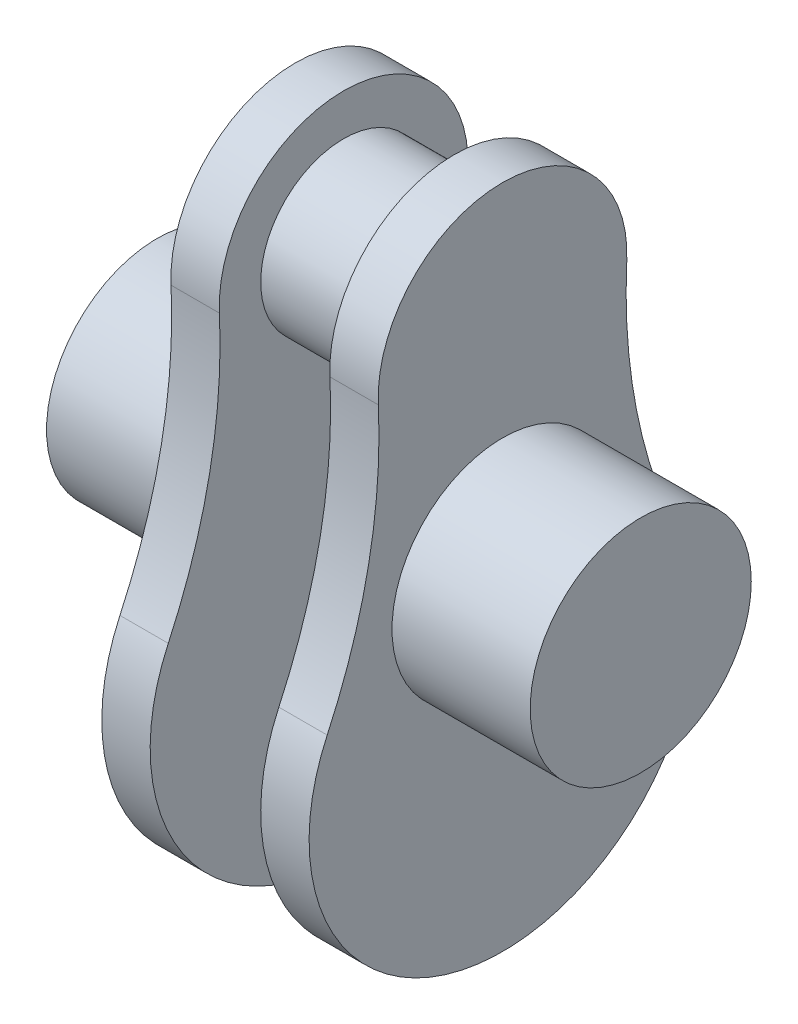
ISO-10303-21;
HEADER;
FILE_DESCRIPTION(('STEP AP214'),'2;1');
FILE_NAME('part.step','',(''),(''),'','','');
FILE_SCHEMA(('AUTOMOTIVE_DESIGN { 1 0 10303 214 1 1 1 1 }'));
ENDSEC;
DATA;
#1=APPLICATION_CONTEXT('core data for automotive mechanical design processes');
#2=APPLICATION_PROTOCOL_DEFINITION('international standard','automotive_design',2000,#1);
#3=PRODUCT_CONTEXT('',#1,'mechanical');
#4=PRODUCT('Part','Part','',(#3));
#5=PRODUCT_RELATED_PRODUCT_CATEGORY('part','',(#4));
#6=PRODUCT_DEFINITION_FORMATION('','',#4);
#7=PRODUCT_DEFINITION_CONTEXT('part definition',#1,'design');
#8=PRODUCT_DEFINITION('design','',#6,#7);
#9=PRODUCT_DEFINITION_SHAPE('','',#8);
#10=(LENGTH_UNIT() NAMED_UNIT(*) SI_UNIT(.MILLI.,.METRE.));
#11=(NAMED_UNIT(*) PLANE_ANGLE_UNIT() SI_UNIT($,.RADIAN.));
#12=(NAMED_UNIT(*) SI_UNIT($,.STERADIAN.) SOLID_ANGLE_UNIT());
#13=UNCERTAINTY_MEASURE_WITH_UNIT(LENGTH_MEASURE(1.E-05),#10,'distance_accuracy_value','');
#14=(GEOMETRIC_REPRESENTATION_CONTEXT(3) GLOBAL_UNCERTAINTY_ASSIGNED_CONTEXT((#13)) GLOBAL_UNIT_ASSIGNED_CONTEXT((#10,
#11,#12)) REPRESENTATION_CONTEXT('',''));
#15=CARTESIAN_POINT('',(0.,0.,0.));
#16=DIRECTION('',(0.,0.,1.));
#17=DIRECTION('',(1.,0.,0.));
#18=AXIS2_PLACEMENT_3D('',#15,#16,#17);
#19=CARTESIAN_POINT('',(-37.5,0.,0.));
#20=DIRECTION('',(-1.,0.,0.));
#21=DIRECTION('',(0.,0.,1.));
#22=AXIS2_PLACEMENT_3D('',#19,#20,#21);
#23=CYLINDRICAL_SURFACE('',#22,40.);
#24=CARTESIAN_POINT('',(-37.5,0.,0.));
#25=DIRECTION('',(1.,0.,0.));
#26=DIRECTION('',(0.,0.,-1.));
#27=AXIS2_PLACEMENT_3D('',#24,#25,#26);
#28=CIRCLE('',#27,40.);
#29=CARTESIAN_POINT('',(-37.5,0.,-40.));
#30=VERTEX_POINT('',#29);
#31=EDGE_CURVE('E11',#30,#30,#28,.T.);
#32=ORIENTED_EDGE('',*,*,#31,.F.);
#33=EDGE_LOOP('',(#32));
#34=FACE_BOUND('',#33,.T.);
#35=CARTESIAN_POINT('',(-87.5,0.,0.));
#36=DIRECTION('',(1.,0.,0.));
#37=DIRECTION('',(0.,0.,-1.));
#38=AXIS2_PLACEMENT_3D('',#35,#36,#37);
#39=CIRCLE('',#38,40.);
#40=CARTESIAN_POINT('',(-87.5,0.,-40.));
#41=VERTEX_POINT('',#40);
#42=EDGE_CURVE('E40',#41,#41,#39,.T.);
#43=ORIENTED_EDGE('',*,*,#42,.T.);
#44=EDGE_LOOP('',(#43));
#45=FACE_BOUND('',#44,.T.);
#46=ADVANCED_FACE('F37',(#34,#45),#23,.T.);
#47=CARTESIAN_POINT('',(-87.5,0.,0.));
#48=DIRECTION('',(1.,0.,0.));
#49=DIRECTION('',(0.,0.,-1.));
#50=AXIS2_PLACEMENT_3D('',#47,#48,#49);
#51=PLANE('',#50);
#52=ORIENTED_EDGE('',*,*,#42,.F.);
#53=EDGE_LOOP('',(#52));
#54=FACE_BOUND('',#53,.T.);
#55=ADVANCED_FACE('F208',(#54),#51,.F.);
#56=CARTESIAN_POINT('',(258.713114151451,63.0912698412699,-244.710404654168));
#57=DIRECTION('',(-1.,0.,0.));
#58=DIRECTION('',(0.,0.,1.));
#59=AXIS2_PLACEMENT_3D('',#56,#57,#58);
#60=CYLINDRICAL_SURFACE('',#59,200.);
#61=CARTESIAN_POINT('',(-20.,63.0912698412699,-244.710404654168));
#62=DIRECTION('',(1.,0.,0.));
#63=DIRECTION('',(0.,0.,-1.));
#64=AXIS2_PLACEMENT_3D('',#61,#62,#63);
#65=CIRCLE('',#64,200.);
#66=CARTESIAN_POINT('',(-20.,-21.4207818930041,-63.4434382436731));
#67=VERTEX_POINT('',#66);
#68=CARTESIAN_POINT('',(-20.,72.8126822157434,-44.9468090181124));
#69=VERTEX_POINT('',#68);
#70=EDGE_CURVE('E178',#67,#69,#65,.F.);
#71=ORIENTED_EDGE('',*,*,#70,.F.);
#72=DIRECTION('',(-1.,0.,0.));
#73=VECTOR('',#72,1.);
#74=CARTESIAN_POINT('',(258.713114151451,-21.4207818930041,-63.4434382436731));
#75=LINE('',#74,#73);
#76=CARTESIAN_POINT('',(-37.5,-21.4207818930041,-63.4434382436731));
#77=VERTEX_POINT('',#76);
#78=EDGE_CURVE('E51',#67,#77,#75,.T.);
#79=ORIENTED_EDGE('',*,*,#78,.T.);
#80=CARTESIAN_POINT('',(-37.5,63.0912698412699,-244.710404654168));
#81=DIRECTION('',(-1.,0.,0.));
#82=DIRECTION('',(0.,0.,1.));
#83=AXIS2_PLACEMENT_3D('',#80,#81,#82);
#84=CIRCLE('',#83,200.);
#85=CARTESIAN_POINT('',(-37.5,72.8126822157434,-44.9468090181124));
#86=VERTEX_POINT('',#85);
#87=EDGE_CURVE('E171',#77,#86,#84,.T.);
#88=ORIENTED_EDGE('',*,*,#87,.T.);
#89=DIRECTION('',(-1.,0.,0.));
#90=VECTOR('',#89,1.);
#91=CARTESIAN_POINT('',(258.713114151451,72.8126822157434,-44.9468090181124));
#92=LINE('',#91,#90);
#93=EDGE_CURVE('E74',#69,#86,#92,.T.);
#94=ORIENTED_EDGE('',*,*,#93,.F.);
#95=EDGE_LOOP('',(#71,#79,#88,#94));
#96=FACE_BOUND('',#95,.T.);
#97=ADVANCED_FACE('F187',(#96),#60,.F.);
#98=CARTESIAN_POINT('',(258.713114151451,75.,0.));
#99=DIRECTION('',(-1.,0.,0.));
#100=DIRECTION('',(0.,0.,1.));
#101=AXIS2_PLACEMENT_3D('',#98,#99,#100);
#102=CYLINDRICAL_SURFACE('',#101,45.);
#103=CARTESIAN_POINT('',(-20.,75.,0.));
#104=DIRECTION('',(1.,0.,0.));
#105=DIRECTION('',(0.,0.,-1.));
#106=AXIS2_PLACEMENT_3D('',#103,#104,#105);
#107=CIRCLE('',#106,45.);
#108=CARTESIAN_POINT('',(-20.,72.8126822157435,44.9468090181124));
#109=VERTEX_POINT('',#108);
#110=EDGE_CURVE('E80',#69,#109,#107,.T.);
#111=ORIENTED_EDGE('',*,*,#110,.F.);
#112=ORIENTED_EDGE('',*,*,#93,.T.);
#113=CARTESIAN_POINT('',(-37.5,75.,0.));
#114=DIRECTION('',(1.,0.,0.));
#115=DIRECTION('',(0.,0.,-1.));
#116=AXIS2_PLACEMENT_3D('',#113,#114,#115);
#117=CIRCLE('',#116,45.);
#118=CARTESIAN_POINT('',(-37.5,72.8126822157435,44.9468090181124));
#119=VERTEX_POINT('',#118);
#120=EDGE_CURVE('E169',#86,#119,#117,.T.);
#121=ORIENTED_EDGE('',*,*,#120,.T.);
#122=DIRECTION('',(-1.,0.,0.));
#123=VECTOR('',#122,1.);
#124=CARTESIAN_POINT('',(258.713114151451,72.8126822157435,44.9468090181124));
#125=LINE('',#124,#123);
#126=EDGE_CURVE('E168',#109,#119,#125,.T.);
#127=ORIENTED_EDGE('',*,*,#126,.F.);
#128=EDGE_LOOP('',(#111,#112,#121,#127));
#129=FACE_BOUND('',#128,.T.);
#130=ADVANCED_FACE('F194',(#129),#102,.T.);
#131=CARTESIAN_POINT('',(258.713114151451,63.0912698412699,244.710404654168));
#132=DIRECTION('',(-1.,0.,0.));
#133=DIRECTION('',(0.,0.,1.));
#134=AXIS2_PLACEMENT_3D('',#131,#132,#133);
#135=CYLINDRICAL_SURFACE('',#134,200.);
#136=CARTESIAN_POINT('',(-20.,63.0912698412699,244.710404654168));
#137=DIRECTION('',(1.,0.,0.));
#138=DIRECTION('',(0.,0.,-1.));
#139=AXIS2_PLACEMENT_3D('',#136,#137,#138);
#140=CIRCLE('',#139,200.);
#141=CARTESIAN_POINT('',(-20.,-21.4207818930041,63.4434382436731));
#142=VERTEX_POINT('',#141);
#143=EDGE_CURVE('E174',#109,#142,#140,.F.);
#144=ORIENTED_EDGE('',*,*,#143,.F.);
#145=ORIENTED_EDGE('',*,*,#126,.T.);
#146=CARTESIAN_POINT('',(-37.5,63.0912698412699,244.710404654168));
#147=DIRECTION('',(-1.,0.,0.));
#148=DIRECTION('',(0.,0.,-1.));
#149=AXIS2_PLACEMENT_3D('',#146,#147,#148);
#150=CIRCLE('',#149,200.);
#151=CARTESIAN_POINT('',(-37.5,-21.4207818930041,63.4434382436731));
#152=VERTEX_POINT('',#151);
#153=EDGE_CURVE('E166',#119,#152,#150,.T.);
#154=ORIENTED_EDGE('',*,*,#153,.T.);
#155=DIRECTION('',(-1.,0.,0.));
#156=VECTOR('',#155,1.);
#157=CARTESIAN_POINT('',(258.713114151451,-21.4207818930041,63.4434382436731));
#158=LINE('',#157,#156);
#159=EDGE_CURVE('E57',#142,#152,#158,.T.);
#160=ORIENTED_EDGE('',*,*,#159,.F.);
#161=EDGE_LOOP('',(#144,#145,#154,#160));
#162=FACE_BOUND('',#161,.T.);
#163=ADVANCED_FACE('F198',(#162),#135,.F.);
#164=CARTESIAN_POINT('',(258.713114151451,-51.,0.));
#165=DIRECTION('',(-1.,0.,0.));
#166=DIRECTION('',(0.,0.,1.));
#167=AXIS2_PLACEMENT_3D('',#164,#165,#166);
#168=CYLINDRICAL_SURFACE('',#167,70.);
#169=CARTESIAN_POINT('',(-20.,-51.,0.));
#170=DIRECTION('',(1.,0.,0.));
#171=DIRECTION('',(0.,0.,-1.));
#172=AXIS2_PLACEMENT_3D('',#169,#170,#171);
#173=CIRCLE('',#172,70.);
#174=EDGE_CURVE('E165',#142,#67,#173,.T.);
#175=ORIENTED_EDGE('',*,*,#174,.F.);
#176=ORIENTED_EDGE('',*,*,#159,.T.);
#177=CARTESIAN_POINT('',(-37.5,-51.,0.));
#178=DIRECTION('',(1.,0.,0.));
#179=DIRECTION('',(0.,0.,-1.));
#180=AXIS2_PLACEMENT_3D('',#177,#178,#179);
#181=CIRCLE('',#180,70.);
#182=EDGE_CURVE('E163',#152,#77,#181,.T.);
#183=ORIENTED_EDGE('',*,*,#182,.T.);
#184=ORIENTED_EDGE('',*,*,#78,.F.);
#185=EDGE_LOOP('',(#175,#176,#183,#184));
#186=FACE_BOUND('',#185,.T.);
#187=ADVANCED_FACE('F190',(#186),#168,.T.);
#188=CARTESIAN_POINT('',(-37.5,69.0456349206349,-122.355202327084));
#189=DIRECTION('',(-1.,0.,0.));
#190=DIRECTION('',(0.,0.,1.));
#191=AXIS2_PLACEMENT_3D('',#188,#189,#190);
#192=PLANE('',#191);
#193=ORIENTED_EDGE('',*,*,#31,.T.);
#194=EDGE_LOOP('',(#193));
#195=FACE_BOUND('',#194,.T.);
#196=ORIENTED_EDGE('',*,*,#87,.F.);
#197=ORIENTED_EDGE('',*,*,#182,.F.);
#198=ORIENTED_EDGE('',*,*,#153,.F.);
#199=ORIENTED_EDGE('',*,*,#120,.F.);
#200=EDGE_LOOP('',(#196,#197,#198,#199));
#201=FACE_BOUND('',#200,.T.);
#202=ADVANCED_FACE('F193',(#195,#201),#192,.T.);
#203=CARTESIAN_POINT('',(-20.,75.,0.));
#204=DIRECTION('',(1.,0.,0.));
#205=DIRECTION('',(0.,0.,-1.));
#206=AXIS2_PLACEMENT_3D('',#203,#204,#205);
#207=PLANE('',#206);
#208=CARTESIAN_POINT('',(-20.,75.,0.));
#209=DIRECTION('',(1.,0.,0.));
#210=DIRECTION('',(0.,0.,-1.));
#211=AXIS2_PLACEMENT_3D('',#208,#209,#210);
#212=CIRCLE('',#211,30.);
#213=CARTESIAN_POINT('',(-20.,75.,-30.));
#214=VERTEX_POINT('',#213);
#215=EDGE_CURVE('E157',#214,#214,#212,.T.);
#216=ORIENTED_EDGE('',*,*,#215,.F.);
#217=EDGE_LOOP('',(#216));
#218=FACE_BOUND('',#217,.T.);
#219=ORIENTED_EDGE('',*,*,#174,.T.);
#220=ORIENTED_EDGE('',*,*,#70,.T.);
#221=ORIENTED_EDGE('',*,*,#110,.T.);
#222=ORIENTED_EDGE('',*,*,#143,.T.);
#223=EDGE_LOOP('',(#219,#220,#221,#222));
#224=FACE_BOUND('',#223,.T.);
#225=ADVANCED_FACE('F197',(#218,#224),#207,.T.);
#226=CARTESIAN_POINT('',(20.,75.,0.));
#227=DIRECTION('',(-1.,0.,0.));
#228=DIRECTION('',(0.,0.,1.));
#229=AXIS2_PLACEMENT_3D('',#226,#227,#228);
#230=CYLINDRICAL_SURFACE('',#229,30.);
#231=CARTESIAN_POINT('',(20.,75.,0.));
#232=DIRECTION('',(1.,0.,0.));
#233=DIRECTION('',(0.,0.,-1.));
#234=AXIS2_PLACEMENT_3D('',#231,#232,#233);
#235=CIRCLE('',#234,30.);
#236=CARTESIAN_POINT('',(20.,75.,-30.));
#237=VERTEX_POINT('',#236);
#238=EDGE_CURVE('E158',#237,#237,#235,.T.);
#239=ORIENTED_EDGE('',*,*,#238,.F.);
#240=EDGE_LOOP('',(#239));
#241=FACE_BOUND('',#240,.T.);
#242=ORIENTED_EDGE('',*,*,#215,.T.);
#243=EDGE_LOOP('',(#242));
#244=FACE_BOUND('',#243,.T.);
#245=ADVANCED_FACE('F224',(#241,#244),#230,.T.);
#246=CARTESIAN_POINT('',(87.5,0.,0.));
#247=DIRECTION('',(-1.,0.,0.));
#248=DIRECTION('',(0.,0.,-1.));
#249=AXIS2_PLACEMENT_3D('',#246,#247,#248);
#250=PLANE('',#249);
#251=CARTESIAN_POINT('',(87.5,0.,0.));
#252=DIRECTION('',(1.,0.,0.));
#253=DIRECTION('',(0.,0.,-1.));
#254=AXIS2_PLACEMENT_3D('',#251,#252,#253);
#255=CIRCLE('',#254,40.);
#256=CARTESIAN_POINT('',(87.5,0.,-40.));
#257=VERTEX_POINT('',#256);
#258=EDGE_CURVE('E154',#257,#257,#255,.T.);
#259=ORIENTED_EDGE('',*,*,#258,.T.);
#260=EDGE_LOOP('',(#259));
#261=FACE_BOUND('',#260,.T.);
#262=ADVANCED_FACE('F230',(#261),#250,.F.);
#263=CARTESIAN_POINT('',(37.5,0.,0.));
#264=DIRECTION('',(1.,0.,0.));
#265=DIRECTION('',(0.,0.,1.));
#266=AXIS2_PLACEMENT_3D('',#263,#264,#265);
#267=CYLINDRICAL_SURFACE('',#266,40.);
#268=CARTESIAN_POINT('',(37.5,0.,0.));
#269=DIRECTION('',(1.,0.,0.));
#270=DIRECTION('',(0.,0.,-1.));
#271=AXIS2_PLACEMENT_3D('',#268,#269,#270);
#272=CIRCLE('',#271,40.);
#273=CARTESIAN_POINT('',(37.5,0.,-40.));
#274=VERTEX_POINT('',#273);
#275=EDGE_CURVE('E126',#274,#274,#272,.T.);
#276=ORIENTED_EDGE('',*,*,#275,.T.);
#277=EDGE_LOOP('',(#276));
#278=FACE_BOUND('',#277,.T.);
#279=ORIENTED_EDGE('',*,*,#258,.F.);
#280=EDGE_LOOP('',(#279));
#281=FACE_BOUND('',#280,.T.);
#282=ADVANCED_FACE('F234',(#278,#281),#267,.T.);
#283=CARTESIAN_POINT('',(-258.713114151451,63.0912698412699,-244.710404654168));
#284=DIRECTION('',(1.,0.,0.));
#285=DIRECTION('',(0.,0.,1.));
#286=AXIS2_PLACEMENT_3D('',#283,#284,#285);
#287=CYLINDRICAL_SURFACE('',#286,200.);
#288=CARTESIAN_POINT('',(20.,63.0912698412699,-244.710404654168));
#289=DIRECTION('',(1.,0.,0.));
#290=DIRECTION('',(0.,0.,-1.));
#291=AXIS2_PLACEMENT_3D('',#288,#289,#290);
#292=CIRCLE('',#291,200.);
#293=CARTESIAN_POINT('',(20.,-21.4207818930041,-63.4434382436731));
#294=VERTEX_POINT('',#293);
#295=CARTESIAN_POINT('',(20.,72.8126822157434,-44.9468090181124));
#296=VERTEX_POINT('',#295);
#297=EDGE_CURVE('E118',#294,#296,#292,.F.);
#298=ORIENTED_EDGE('',*,*,#297,.T.);
#299=DIRECTION('',(1.,0.,0.));
#300=VECTOR('',#299,1.);
#301=CARTESIAN_POINT('',(-258.713114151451,72.8126822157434,-44.9468090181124));
#302=LINE('',#301,#300);
#303=CARTESIAN_POINT('',(37.5,72.8126822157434,-44.9468090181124));
#304=VERTEX_POINT('',#303);
#305=EDGE_CURVE('E152',#296,#304,#302,.T.);
#306=ORIENTED_EDGE('',*,*,#305,.T.);
#307=CARTESIAN_POINT('',(37.5,63.0912698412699,-244.710404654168));
#308=DIRECTION('',(-1.,0.,0.));
#309=DIRECTION('',(0.,0.,1.));
#310=AXIS2_PLACEMENT_3D('',#307,#308,#309);
#311=CIRCLE('',#310,200.);
#312=CARTESIAN_POINT('',(37.5,-21.4207818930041,-63.4434382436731));
#313=VERTEX_POINT('',#312);
#314=EDGE_CURVE('E125',#313,#304,#311,.T.);
#315=ORIENTED_EDGE('',*,*,#314,.F.);
#316=DIRECTION('',(1.,0.,0.));
#317=VECTOR('',#316,1.);
#318=CARTESIAN_POINT('',(-258.713114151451,-21.4207818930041,-63.4434382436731));
#319=LINE('',#318,#317);
#320=EDGE_CURVE('E111',#294,#313,#319,.T.);
#321=ORIENTED_EDGE('',*,*,#320,.F.);
#322=EDGE_LOOP('',(#298,#306,#315,#321));
#323=FACE_BOUND('',#322,.T.);
#324=ADVANCED_FACE('F122',(#323),#287,.F.);
#325=CARTESIAN_POINT('',(-258.713114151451,75.,0.));
#326=DIRECTION('',(1.,0.,0.));
#327=DIRECTION('',(0.,0.,1.));
#328=AXIS2_PLACEMENT_3D('',#325,#326,#327);
#329=CYLINDRICAL_SURFACE('',#328,45.);
#330=CARTESIAN_POINT('',(20.,75.,0.));
#331=DIRECTION('',(1.,0.,0.));
#332=DIRECTION('',(0.,0.,-1.));
#333=AXIS2_PLACEMENT_3D('',#330,#331,#332);
#334=CIRCLE('',#333,45.);
#335=CARTESIAN_POINT('',(20.,72.8126822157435,44.9468090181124));
#336=VERTEX_POINT('',#335);
#337=EDGE_CURVE('E131',#296,#336,#334,.T.);
#338=ORIENTED_EDGE('',*,*,#337,.T.);
#339=DIRECTION('',(1.,0.,0.));
#340=VECTOR('',#339,1.);
#341=CARTESIAN_POINT('',(-258.713114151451,72.8126822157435,44.9468090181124));
#342=LINE('',#341,#340);
#343=CARTESIAN_POINT('',(37.5,72.8126822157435,44.9468090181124));
#344=VERTEX_POINT('',#343);
#345=EDGE_CURVE('E149',#336,#344,#342,.T.);
#346=ORIENTED_EDGE('',*,*,#345,.T.);
#347=CARTESIAN_POINT('',(37.5,75.,0.));
#348=DIRECTION('',(1.,0.,0.));
#349=DIRECTION('',(0.,0.,-1.));
#350=AXIS2_PLACEMENT_3D('',#347,#348,#349);
#351=CIRCLE('',#350,45.);
#352=EDGE_CURVE('E146',#304,#344,#351,.T.);
#353=ORIENTED_EDGE('',*,*,#352,.F.);
#354=ORIENTED_EDGE('',*,*,#305,.F.);
#355=EDGE_LOOP('',(#338,#346,#353,#354));
#356=FACE_BOUND('',#355,.T.);
#357=ADVANCED_FACE('F241',(#356),#329,.T.);
#358=CARTESIAN_POINT('',(-258.713114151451,63.0912698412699,244.710404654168));
#359=DIRECTION('',(1.,0.,0.));
#360=DIRECTION('',(0.,0.,1.));
#361=AXIS2_PLACEMENT_3D('',#358,#359,#360);
#362=CYLINDRICAL_SURFACE('',#361,200.);
#363=CARTESIAN_POINT('',(20.,63.0912698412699,244.710404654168));
#364=DIRECTION('',(1.,0.,0.));
#365=DIRECTION('',(0.,0.,-1.));
#366=AXIS2_PLACEMENT_3D('',#363,#364,#365);
#367=CIRCLE('',#366,200.);
#368=CARTESIAN_POINT('',(20.,-21.4207818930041,63.4434382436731));
#369=VERTEX_POINT('',#368);
#370=EDGE_CURVE('E134',#336,#369,#367,.F.);
#371=ORIENTED_EDGE('',*,*,#370,.T.);
#372=DIRECTION('',(1.,0.,0.));
#373=VECTOR('',#372,1.);
#374=CARTESIAN_POINT('',(-258.713114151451,-21.4207818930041,63.4434382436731));
#375=LINE('',#374,#373);
#376=CARTESIAN_POINT('',(37.5,-21.4207818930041,63.4434382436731));
#377=VERTEX_POINT('',#376);
#378=EDGE_CURVE('E114',#369,#377,#375,.T.);
#379=ORIENTED_EDGE('',*,*,#378,.T.);
#380=CARTESIAN_POINT('',(37.5,63.0912698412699,244.710404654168));
#381=DIRECTION('',(-1.,0.,0.));
#382=DIRECTION('',(0.,0.,-1.));
#383=AXIS2_PLACEMENT_3D('',#380,#381,#382);
#384=CIRCLE('',#383,200.);
#385=EDGE_CURVE('E143',#344,#377,#384,.T.);
#386=ORIENTED_EDGE('',*,*,#385,.F.);
#387=ORIENTED_EDGE('',*,*,#345,.F.);
#388=EDGE_LOOP('',(#371,#379,#386,#387));
#389=FACE_BOUND('',#388,.T.);
#390=ADVANCED_FACE('F244',(#389),#362,.F.);
#391=CARTESIAN_POINT('',(37.5,69.0456349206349,-122.355202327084));
#392=DIRECTION('',(1.,0.,0.));
#393=DIRECTION('',(0.,0.,1.));
#394=AXIS2_PLACEMENT_3D('',#391,#392,#393);
#395=PLANE('',#394);
#396=ORIENTED_EDGE('',*,*,#275,.F.);
#397=EDGE_LOOP('',(#396));
#398=FACE_BOUND('',#397,.T.);
#399=ORIENTED_EDGE('',*,*,#314,.T.);
#400=ORIENTED_EDGE('',*,*,#352,.T.);
#401=ORIENTED_EDGE('',*,*,#385,.T.);
#402=CARTESIAN_POINT('',(37.5,-51.,0.));
#403=DIRECTION('',(1.,0.,0.));
#404=DIRECTION('',(0.,0.,-1.));
#405=AXIS2_PLACEMENT_3D('',#402,#403,#404);
#406=CIRCLE('',#405,70.);
#407=EDGE_CURVE('E127',#377,#313,#406,.T.);
#408=ORIENTED_EDGE('',*,*,#407,.T.);
#409=EDGE_LOOP('',(#399,#400,#401,#408));
#410=FACE_BOUND('',#409,.T.);
#411=ADVANCED_FACE('F248',(#398,#410),#395,.T.);
#412=CARTESIAN_POINT('',(-258.713114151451,-51.,0.));
#413=DIRECTION('',(1.,0.,0.));
#414=DIRECTION('',(0.,0.,1.));
#415=AXIS2_PLACEMENT_3D('',#412,#413,#414);
#416=CYLINDRICAL_SURFACE('',#415,70.);
#417=CARTESIAN_POINT('',(20.,-51.,0.));
#418=DIRECTION('',(1.,0.,0.));
#419=DIRECTION('',(0.,0.,-1.));
#420=AXIS2_PLACEMENT_3D('',#417,#418,#419);
#421=CIRCLE('',#420,70.);
#422=EDGE_CURVE('E108',#369,#294,#421,.T.);
#423=ORIENTED_EDGE('',*,*,#422,.T.);
#424=ORIENTED_EDGE('',*,*,#320,.T.);
#425=ORIENTED_EDGE('',*,*,#407,.F.);
#426=ORIENTED_EDGE('',*,*,#378,.F.);
#427=EDGE_LOOP('',(#423,#424,#425,#426));
#428=FACE_BOUND('',#427,.T.);
#429=ADVANCED_FACE('F110',(#428),#416,.T.);
#430=CARTESIAN_POINT('',(20.,75.,0.));
#431=DIRECTION('',(-1.,0.,0.));
#432=DIRECTION('',(0.,0.,-1.));
#433=AXIS2_PLACEMENT_3D('',#430,#431,#432);
#434=PLANE('',#433);
#435=ORIENTED_EDGE('',*,*,#238,.T.);
#436=EDGE_LOOP('',(#435));
#437=FACE_BOUND('',#436,.T.);
#438=ORIENTED_EDGE('',*,*,#422,.F.);
#439=ORIENTED_EDGE('',*,*,#370,.F.);
#440=ORIENTED_EDGE('',*,*,#337,.F.);
#441=ORIENTED_EDGE('',*,*,#297,.F.);
#442=EDGE_LOOP('',(#438,#439,#440,#441));
#443=FACE_BOUND('',#442,.T.);
#444=ADVANCED_FACE('F129',(#437,#443),#434,.T.);
#445=CLOSED_SHELL('',(#46,#55,#97,#130,#163,#187,#202,#225,#245,#262,#282,#324,#357,#390,#411,
#429,#444));
#446=MANIFOLD_SOLID_BREP('B2',#445);
#447=ADVANCED_BREP_SHAPE_REPRESENTATION('',(#18,#446),#14);
#448=SHAPE_DEFINITION_REPRESENTATION(#9,#447);
ENDSEC;
END-ISO-10303-21;
